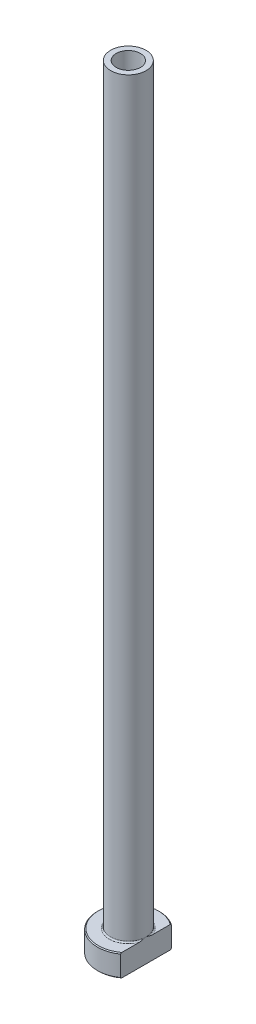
ISO-10303-21;
HEADER;
FILE_DESCRIPTION(('STEP AP214'),'2;1');
FILE_NAME('part.step','',(''),(''),'','','');
FILE_SCHEMA(('AUTOMOTIVE_DESIGN { 1 0 10303 214 1 1 1 1 }'));
ENDSEC;
DATA;
#1=APPLICATION_CONTEXT('core data for automotive mechanical design processes');
#2=APPLICATION_PROTOCOL_DEFINITION('international standard','automotive_design',2000,#1);
#3=PRODUCT_CONTEXT('',#1,'mechanical');
#4=PRODUCT('Part','Part','',(#3));
#5=PRODUCT_RELATED_PRODUCT_CATEGORY('part','',(#4));
#6=PRODUCT_DEFINITION_FORMATION('','',#4);
#7=PRODUCT_DEFINITION_CONTEXT('part definition',#1,'design');
#8=PRODUCT_DEFINITION('design','',#6,#7);
#9=PRODUCT_DEFINITION_SHAPE('','',#8);
#10=(LENGTH_UNIT() NAMED_UNIT(*) SI_UNIT(.MILLI.,.METRE.));
#11=(NAMED_UNIT(*) PLANE_ANGLE_UNIT() SI_UNIT($,.RADIAN.));
#12=(NAMED_UNIT(*) SI_UNIT($,.STERADIAN.) SOLID_ANGLE_UNIT());
#13=UNCERTAINTY_MEASURE_WITH_UNIT(LENGTH_MEASURE(1.E-05),#10,'distance_accuracy_value','');
#14=(GEOMETRIC_REPRESENTATION_CONTEXT(3) GLOBAL_UNCERTAINTY_ASSIGNED_CONTEXT((#13)) GLOBAL_UNIT_ASSIGNED_CONTEXT((#10,
#11,#12)) REPRESENTATION_CONTEXT('',''));
#15=CARTESIAN_POINT('',(0.,0.,0.));
#16=DIRECTION('',(0.,0.,1.));
#17=DIRECTION('',(1.,0.,0.));
#18=AXIS2_PLACEMENT_3D('',#15,#16,#17);
#19=CARTESIAN_POINT('',(0.,92.1876809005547,0.));
#20=DIRECTION('',(0.,1.,0.));
#21=DIRECTION('',(0.,0.,1.));
#22=AXIS2_PLACEMENT_3D('',#19,#20,#21);
#23=CYLINDRICAL_SURFACE('',#22,2.75);
#24=CARTESIAN_POINT('',(0.,175.,0.));
#25=DIRECTION('',(0.,1.,0.));
#26=DIRECTION('',(0.,0.,1.));
#27=AXIS2_PLACEMENT_3D('',#24,#25,#26);
#28=CIRCLE('',#27,2.75);
#29=CARTESIAN_POINT('',(0.,175.,2.75));
#30=VERTEX_POINT('',#29);
#31=EDGE_CURVE('E167',#30,#30,#28,.T.);
#32=ORIENTED_EDGE('',*,*,#31,.T.);
#33=EDGE_LOOP('',(#32));
#34=FACE_BOUND('',#33,.T.);
#35=CARTESIAN_POINT('',(0.,130.,0.));
#36=DIRECTION('',(0.,1.,0.));
#37=DIRECTION('',(0.,0.,1.));
#38=AXIS2_PLACEMENT_3D('',#35,#36,#37);
#39=CIRCLE('',#38,2.75);
#40=CARTESIAN_POINT('',(0.,130.,2.75));
#41=VERTEX_POINT('',#40);
#42=EDGE_CURVE('E170',#41,#41,#39,.T.);
#43=ORIENTED_EDGE('',*,*,#42,.F.);
#44=EDGE_LOOP('',(#43));
#45=FACE_BOUND('',#44,.T.);
#46=ADVANCED_FACE('F32',(#34,#45),#23,.F.);
#47=CARTESIAN_POINT('',(-2.75,175.,0.));
#48=DIRECTION('',(0.,1.,0.));
#49=DIRECTION('',(0.,0.,1.));
#50=AXIS2_PLACEMENT_3D('',#47,#48,#49);
#51=PLANE('',#50);
#52=CARTESIAN_POINT('',(0.,175.,0.));
#53=DIRECTION('',(0.,1.,0.));
#54=DIRECTION('',(0.,0.,1.));
#55=AXIS2_PLACEMENT_3D('',#52,#53,#54);
#56=CIRCLE('',#55,4.00000000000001);
#57=CARTESIAN_POINT('',(0.,175.,4.00000000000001));
#58=VERTEX_POINT('',#57);
#59=EDGE_CURVE('E174',#58,#58,#56,.T.);
#60=ORIENTED_EDGE('',*,*,#59,.T.);
#61=EDGE_LOOP('',(#60));
#62=FACE_BOUND('',#61,.T.);
#63=ORIENTED_EDGE('',*,*,#31,.F.);
#64=EDGE_LOOP('',(#63));
#65=FACE_BOUND('',#64,.T.);
#66=ADVANCED_FACE('F157',(#62,#65),#51,.T.);
#67=CARTESIAN_POINT('',(0.,92.1876809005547,0.));
#68=DIRECTION('',(0.,1.,0.));
#69=DIRECTION('',(0.,0.,1.));
#70=AXIS2_PLACEMENT_3D('',#67,#68,#69);
#71=CYLINDRICAL_SURFACE('',#70,4.);
#72=CARTESIAN_POINT('',(0.,5.3,0.));
#73=DIRECTION('',(0.,1.,0.));
#74=DIRECTION('',(0.,0.,1.));
#75=AXIS2_PLACEMENT_3D('',#72,#73,#74);
#76=CIRCLE('',#75,4.);
#77=CARTESIAN_POINT('',(4.,5.3,0.));
#78=VERTEX_POINT('',#77);
#79=EDGE_CURVE('E180',#78,#78,#76,.T.);
#80=ORIENTED_EDGE('',*,*,#79,.T.);
#81=EDGE_LOOP('',(#80));
#82=FACE_BOUND('',#81,.T.);
#83=ORIENTED_EDGE('',*,*,#59,.F.);
#84=EDGE_LOOP('',(#83));
#85=FACE_BOUND('',#84,.T.);
#86=ADVANCED_FACE('F162',(#82,#85),#71,.T.);
#87=CARTESIAN_POINT('',(-3.99999999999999,5.,0.));
#88=DIRECTION('',(0.,1.,0.));
#89=DIRECTION('',(0.,0.,1.));
#90=AXIS2_PLACEMENT_3D('',#87,#88,#89);
#91=PLANE('',#90);
#92=DIRECTION('',(0.,0.,1.));
#93=VECTOR('',#92,1.);
#94=CARTESIAN_POINT('',(4.,5.,0.));
#95=LINE('',#94,#93);
#96=CARTESIAN_POINT('',(4.,5.,-5.499090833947));
#97=VERTEX_POINT('',#96);
#98=CARTESIAN_POINT('',(4.,5.,-1.57797338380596));
#99=VERTEX_POINT('',#98);
#100=EDGE_CURVE('E54',#97,#99,#95,.T.);
#101=ORIENTED_EDGE('',*,*,#100,.F.);
#102=CARTESIAN_POINT('',(0.,5.,0.));
#103=DIRECTION('',(0.,1.,0.));
#104=DIRECTION('',(0.,0.,1.));
#105=AXIS2_PLACEMENT_3D('',#102,#103,#104);
#106=CIRCLE('',#105,6.79999999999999);
#107=CARTESIAN_POINT('',(3.99999999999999,5.,5.499090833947));
#108=VERTEX_POINT('',#107);
#109=EDGE_CURVE('E186',#97,#108,#106,.T.);
#110=ORIENTED_EDGE('',*,*,#109,.T.);
#111=CARTESIAN_POINT('',(4.,5.,1.57797338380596));
#112=VERTEX_POINT('',#111);
#113=EDGE_CURVE('E134',#112,#108,#95,.T.);
#114=ORIENTED_EDGE('',*,*,#113,.F.);
#115=CARTESIAN_POINT('',(0.,5.,0.));
#116=DIRECTION('',(0.,1.,0.));
#117=DIRECTION('',(0.,0.,1.));
#118=AXIS2_PLACEMENT_3D('',#115,#116,#117);
#119=CIRCLE('',#118,4.3);
#120=EDGE_CURVE('E183',#112,#99,#119,.F.);
#121=ORIENTED_EDGE('',*,*,#120,.T.);
#122=EDGE_LOOP('',(#101,#110,#114,#121));
#123=FACE_BOUND('',#122,.T.);
#124=ADVANCED_FACE('F197',(#123),#91,.T.);
#125=CARTESIAN_POINT('',(0.,92.1876809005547,0.));
#126=DIRECTION('',(0.,1.,0.));
#127=DIRECTION('',(0.,0.,1.));
#128=AXIS2_PLACEMENT_3D('',#125,#126,#127);
#129=CYLINDRICAL_SURFACE('',#128,6.99999999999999);
#130=DIRECTION('',(0.,-1.,0.));
#131=VECTOR('',#130,1.);
#132=CARTESIAN_POINT('',(3.99999999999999,175.,5.74456264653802));
#133=LINE('',#132,#131);
#134=CARTESIAN_POINT('',(3.99999999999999,4.79999999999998,5.74456264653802));
#135=VERTEX_POINT('',#134);
#136=CARTESIAN_POINT('',(3.99999999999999,0.20000000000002,5.74456264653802));
#137=VERTEX_POINT('',#136);
#138=EDGE_CURVE('E82',#135,#137,#133,.T.);
#139=ORIENTED_EDGE('',*,*,#138,.F.);
#140=CARTESIAN_POINT('',(0.,4.79999999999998,0.));
#141=DIRECTION('',(0.,1.,0.));
#142=DIRECTION('',(0.,0.,1.));
#143=AXIS2_PLACEMENT_3D('',#140,#141,#142);
#144=CIRCLE('',#143,6.99999999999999);
#145=CARTESIAN_POINT('',(4.,4.79999999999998,-5.74456264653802));
#146=VERTEX_POINT('',#145);
#147=EDGE_CURVE('E95',#135,#146,#144,.F.);
#148=ORIENTED_EDGE('',*,*,#147,.T.);
#149=DIRECTION('',(0.,-1.,0.));
#150=VECTOR('',#149,1.);
#151=CARTESIAN_POINT('',(4.,175.,-5.74456264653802));
#152=LINE('',#151,#150);
#153=CARTESIAN_POINT('',(4.,0.20000000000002,-5.74456264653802));
#154=VERTEX_POINT('',#153);
#155=EDGE_CURVE('E192',#146,#154,#152,.T.);
#156=ORIENTED_EDGE('',*,*,#155,.T.);
#157=CARTESIAN_POINT('',(0.,0.20000000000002,0.));
#158=DIRECTION('',(0.,-1.,0.));
#159=DIRECTION('',(0.,0.,-1.));
#160=AXIS2_PLACEMENT_3D('',#157,#158,#159);
#161=CIRCLE('',#160,6.99999999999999);
#162=EDGE_CURVE('E98',#154,#137,#161,.F.);
#163=ORIENTED_EDGE('',*,*,#162,.T.);
#164=EDGE_LOOP('',(#139,#148,#156,#163));
#165=FACE_BOUND('',#164,.T.);
#166=ADVANCED_FACE('F190',(#165),#129,.T.);
#167=CARTESIAN_POINT('',(-6.99999999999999,0.,0.));
#168=DIRECTION('',(0.,-1.,0.));
#169=DIRECTION('',(0.,0.,-1.));
#170=AXIS2_PLACEMENT_3D('',#167,#168,#169);
#171=PLANE('',#170);
#172=CARTESIAN_POINT('',(0.,0.,0.));
#173=DIRECTION('',(0.,-1.,0.));
#174=DIRECTION('',(0.,0.,-1.));
#175=AXIS2_PLACEMENT_3D('',#172,#173,#174);
#176=CIRCLE('',#175,3.49999999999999);
#177=CARTESIAN_POINT('',(0.,0.,-3.49999999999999));
#178=VERTEX_POINT('',#177);
#179=EDGE_CURVE('E40',#178,#178,#176,.F.);
#180=ORIENTED_EDGE('',*,*,#179,.T.);
#181=EDGE_LOOP('',(#180));
#182=FACE_BOUND('',#181,.T.);
#183=DIRECTION('',(0.,0.,-1.));
#184=VECTOR('',#183,1.);
#185=CARTESIAN_POINT('',(3.99999999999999,0.,5.74456264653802));
#186=LINE('',#185,#184);
#187=CARTESIAN_POINT('',(3.99999999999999,0.,5.49909083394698));
#188=VERTEX_POINT('',#187);
#189=CARTESIAN_POINT('',(4.,0.,-5.49909083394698));
#190=VERTEX_POINT('',#189);
#191=EDGE_CURVE('E47',#188,#190,#186,.T.);
#192=ORIENTED_EDGE('',*,*,#191,.F.);
#193=CARTESIAN_POINT('',(0.,0.,0.));
#194=DIRECTION('',(0.,-1.,0.));
#195=DIRECTION('',(0.,0.,-1.));
#196=AXIS2_PLACEMENT_3D('',#193,#194,#195);
#197=CIRCLE('',#196,6.79999999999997);
#198=EDGE_CURVE('E92',#188,#190,#197,.T.);
#199=ORIENTED_EDGE('',*,*,#198,.T.);
#200=EDGE_LOOP('',(#192,#199));
#201=FACE_BOUND('',#200,.T.);
#202=ADVANCED_FACE('F91',(#182,#201),#171,.T.);
#203=CARTESIAN_POINT('',(0.,92.1876809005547,0.));
#204=DIRECTION('',(0.,1.,0.));
#205=DIRECTION('',(0.,0.,1.));
#206=AXIS2_PLACEMENT_3D('',#203,#204,#205);
#207=CYLINDRICAL_SURFACE('',#206,3.);
#208=CARTESIAN_POINT('',(0.,0.5,0.));
#209=DIRECTION('',(0.,-1.,0.));
#210=DIRECTION('',(0.,0.,-1.));
#211=AXIS2_PLACEMENT_3D('',#208,#209,#210);
#212=CIRCLE('',#211,3.);
#213=CARTESIAN_POINT('',(0.,0.5,-3.));
#214=VERTEX_POINT('',#213);
#215=EDGE_CURVE('E11',#214,#214,#212,.T.);
#216=ORIENTED_EDGE('',*,*,#215,.T.);
#217=EDGE_LOOP('',(#216));
#218=FACE_BOUND('',#217,.T.);
#219=CARTESIAN_POINT('',(0.,118.,0.));
#220=DIRECTION('',(0.,1.,0.));
#221=DIRECTION('',(0.,0.,1.));
#222=AXIS2_PLACEMENT_3D('',#219,#220,#221);
#223=CIRCLE('',#222,3.);
#224=CARTESIAN_POINT('',(0.,118.,3.));
#225=VERTEX_POINT('',#224);
#226=EDGE_CURVE('E172',#225,#225,#223,.T.);
#227=ORIENTED_EDGE('',*,*,#226,.T.);
#228=EDGE_LOOP('',(#227));
#229=FACE_BOUND('',#228,.T.);
#230=ADVANCED_FACE('F215',(#218,#229),#207,.F.);
#231=CARTESIAN_POINT('',(0.,118.,0.));
#232=DIRECTION('',(0.,-1.,0.));
#233=DIRECTION('',(0.,0.,-1.));
#234=AXIS2_PLACEMENT_3D('',#231,#232,#233);
#235=CONICAL_SURFACE('',#234,3.,0.0208303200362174);
#236=ORIENTED_EDGE('',*,*,#42,.T.);
#237=EDGE_LOOP('',(#236));
#238=FACE_BOUND('',#237,.T.);
#239=ORIENTED_EDGE('',*,*,#226,.F.);
#240=EDGE_LOOP('',(#239));
#241=FACE_BOUND('',#240,.T.);
#242=ADVANCED_FACE('F111',(#238,#241),#235,.F.);
#243=CARTESIAN_POINT('',(0.,5.3,0.));
#244=DIRECTION('',(0.,1.,0.));
#245=DIRECTION('',(0.,0.,1.));
#246=AXIS2_PLACEMENT_3D('',#243,#244,#245);
#247=TOROIDAL_SURFACE('',#246,4.3,0.3);
#248=ORIENTED_EDGE('',*,*,#120,.F.);
#249=CARTESIAN_POINT('',(4.,5.3,0.));
#250=CARTESIAN_POINT('',(4.,5.30000062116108,-1.06261529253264E-10));
#251=CARTESIAN_POINT('',(4.,5.30000124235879,2.17726073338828E-07));
#252=CARTESIAN_POINT('',(4.,5.30000240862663,8.36141018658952E-07));
#253=CARTESIAN_POINT('',(4.,5.30000294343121,1.2501168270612E-06));
#254=CARTESIAN_POINT('',(4.,5.30000404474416,2.23959340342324E-06));
#255=CARTESIAN_POINT('',(4.,5.30000459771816,2.83084465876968E-06));
#256=CARTESIAN_POINT('',(4.,5.30000559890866,4.0651660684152E-06));
#257=CARTESIAN_POINT('',(4.,5.30000604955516,4.70640086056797E-06));
#258=CARTESIAN_POINT('',(4.,5.3000076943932,7.15677214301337E-06));
#259=CARTESIAN_POINT('',(4.,5.3000087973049,9.02995984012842E-06));
#260=CARTESIAN_POINT('',(4.,5.30001063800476,1.27664888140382E-05));
#261=CARTESIAN_POINT('',(4.,5.30001139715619,1.46197807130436E-05));
#262=CARTESIAN_POINT('',(4.,5.30001453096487,2.23679224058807E-05));
#263=CARTESIAN_POINT('',(4.,5.30001683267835,2.82968752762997E-05));
#264=CARTESIAN_POINT('',(4.,5.30002027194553,3.95668733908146E-05));
#265=CARTESIAN_POINT('',(4.,5.30002152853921,4.48715464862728E-05));
#266=CARTESIAN_POINT('',(4.,5.30003060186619,8.40118205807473E-05));
#267=CARTESIAN_POINT('',(4.,5.30003739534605,0.000118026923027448));
#268=CARTESIAN_POINT('',(4.,5.30006713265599,0.00025221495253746));
#269=CARTESIAN_POINT('',(4.,5.30009559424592,0.00035113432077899));
#270=CARTESIAN_POINT('',(3.99999999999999,5.30020622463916,0.000742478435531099));
#271=CARTESIAN_POINT('',(4.,5.30028475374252,0.00103561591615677));
#272=CARTESIAN_POINT('',(4.,5.30059889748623,0.00219920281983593));
#273=CARTESIAN_POINT('',(4.,5.3008390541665,0.00306873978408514));
#274=CARTESIAN_POINT('',(3.99999999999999,5.30183682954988,0.00669141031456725));
#275=CARTESIAN_POINT('',(4.,5.30258877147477,0.00944568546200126));
#276=CARTESIAN_POINT('',(4.,5.31066890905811,0.0390293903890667));
#277=CARTESIAN_POINT('',(4.,5.31802631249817,0.0658531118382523));
#278=CARTESIAN_POINT('',(3.99999999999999,5.3323967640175,0.118441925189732));
#279=CARTESIAN_POINT('',(4.,5.33941183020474,0.144206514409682));
#280=CARTESIAN_POINT('',(4.,5.35427366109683,0.199017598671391));
#281=CARTESIAN_POINT('',(4.,5.36211313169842,0.228066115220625));
#282=CARTESIAN_POINT('',(4.,5.3777634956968,0.28651184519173));
#283=CARTESIAN_POINT('',(4.,5.38557313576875,0.315909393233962));
#284=CARTESIAN_POINT('',(4.,5.40425662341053,0.386994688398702));
#285=CARTESIAN_POINT('',(4.,5.41505237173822,0.428703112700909));
#286=CARTESIAN_POINT('',(4.,5.43592310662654,0.511098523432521));
#287=CARTESIAN_POINT('',(4.,5.44600969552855,0.551782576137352));
#288=CARTESIAN_POINT('',(4.,5.47850986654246,0.686599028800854));
#289=CARTESIAN_POINT('',(4.,5.4997837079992,0.781011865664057));
#290=CARTESIAN_POINT('',(4.,5.53807543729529,0.971847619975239));
#291=CARTESIAN_POINT('',(4.,5.5550427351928,1.06828120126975));
#292=CARTESIAN_POINT('',(4.,5.5758240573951,1.21752725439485));
#293=CARTESIAN_POINT('',(4.,5.5820979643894,1.26999379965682));
#294=CARTESIAN_POINT('',(4.,5.59210686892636,1.37516324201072));
#295=CARTESIAN_POINT('',(4.,5.59584265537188,1.42786606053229));
#296=CARTESIAN_POINT('',(4.,5.60010438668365,1.53310673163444));
#297=CARTESIAN_POINT('',(4.,5.6006487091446,1.58564378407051));
#298=CARTESIAN_POINT('',(4.,5.59767158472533,1.69058605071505));
#299=CARTESIAN_POINT('',(4.,5.59415502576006,1.74299134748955));
#300=CARTESIAN_POINT('',(4.,5.58503062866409,1.81903290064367));
#301=CARTESIAN_POINT('',(4.,5.58157617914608,1.84292934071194));
#302=CARTESIAN_POINT('',(4.,5.57329952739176,1.89051061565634));
#303=CARTESIAN_POINT('',(4.,5.56847619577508,1.91419525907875));
#304=CARTESIAN_POINT('',(4.,5.5572664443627,1.96092888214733));
#305=CARTESIAN_POINT('',(4.,5.55089740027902,1.98398195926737));
#306=CARTESIAN_POINT('',(4.,5.53623434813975,2.02945550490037));
#307=CARTESIAN_POINT('',(4.,5.52794253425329,2.05187666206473));
#308=CARTESIAN_POINT('',(4.,5.50887098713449,2.09590631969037));
#309=CARTESIAN_POINT('',(4.,5.49806837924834,2.1175050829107));
#310=CARTESIAN_POINT('',(4.,5.4733340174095,2.15885583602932));
#311=CARTESIAN_POINT('',(4.,5.45941272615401,2.17861369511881));
#312=CARTESIAN_POINT('',(4.,5.43588221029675,2.20522942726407));
#313=CARTESIAN_POINT('',(4.,5.42781139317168,2.21344043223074));
#314=CARTESIAN_POINT('',(4.,5.4106511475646,2.22875149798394));
#315=CARTESIAN_POINT('',(4.,5.40156129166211,2.23585108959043));
#316=CARTESIAN_POINT('',(4.,5.38220524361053,2.24859694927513));
#317=CARTESIAN_POINT('',(4.,5.37192420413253,2.25422119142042));
#318=CARTESIAN_POINT('',(4.,5.35045072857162,2.26331064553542));
#319=CARTESIAN_POINT('',(4.,5.3392612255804,2.26678251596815));
#320=CARTESIAN_POINT('',(4.,5.31952044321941,2.27051268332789));
#321=CARTESIAN_POINT('',(4.,5.31108453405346,2.27139016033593));
#322=CARTESIAN_POINT('',(4.,5.29418624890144,2.27168963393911));
#323=CARTESIAN_POINT('',(4.,5.28572387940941,2.27111196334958));
#324=CARTESIAN_POINT('',(4.,5.26904138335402,2.26855580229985));
#325=CARTESIAN_POINT('',(4.,5.2608206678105,2.26658107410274));
#326=CARTESIAN_POINT('',(4.,5.2447821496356,2.26139496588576));
#327=CARTESIAN_POINT('',(4.,5.2369646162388,2.25818277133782));
#328=CARTESIAN_POINT('',(4.,5.21851235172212,2.24908332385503));
#329=CARTESIAN_POINT('',(4.,5.20815219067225,2.24264095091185));
#330=CARTESIAN_POINT('',(4.,5.1885797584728,2.22819957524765));
#331=CARTESIAN_POINT('',(4.,5.17937061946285,2.22019647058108));
#332=CARTESIAN_POINT('',(4.,5.1566538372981,2.19777756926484));
#333=CARTESIAN_POINT('',(4.,5.14403484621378,2.18246908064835));
#334=CARTESIAN_POINT('',(4.,5.12118369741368,2.15020843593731));
#335=CARTESIAN_POINT('',(4.,5.1109548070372,2.13325407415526));
#336=CARTESIAN_POINT('',(4.,5.09273574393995,2.09892324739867));
#337=CARTESIAN_POINT('',(4.,5.08468212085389,2.08157988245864));
#338=CARTESIAN_POINT('',(4.,5.07005901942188,2.04627072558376));
#339=CARTESIAN_POINT('',(4.,5.06349101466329,2.02830433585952));
#340=CARTESIAN_POINT('',(4.,5.04555485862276,1.97350761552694));
#341=CARTESIAN_POINT('',(4.,5.03608974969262,1.93605770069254));
#342=CARTESIAN_POINT('',(4.,5.01780569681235,1.84529235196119));
#343=CARTESIAN_POINT('',(4.,5.01077018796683,1.79164082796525));
#344=CARTESIAN_POINT('',(4.,5.00182846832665,1.68379947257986));
#345=CARTESIAN_POINT('',(4.,4.99993887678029,1.62960846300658));
#346=CARTESIAN_POINT('',(4.,5.0000612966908,1.52361204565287));
#347=CARTESIAN_POINT('',(4.,5.00190698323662,1.47180551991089));
#348=CARTESIAN_POINT('',(4.,5.00841243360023,1.36835357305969));
#349=CARTESIAN_POINT('',(4.,5.01307376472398,1.31670825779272));
#350=CARTESIAN_POINT('',(4.,5.02905484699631,1.17431887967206));
#351=CARTESIAN_POINT('',(4.,5.04274090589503,1.08384207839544));
#352=CARTESIAN_POINT('',(4.,5.06701714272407,0.947757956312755));
#353=CARTESIAN_POINT('',(4.,5.07585573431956,0.901814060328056));
#354=CARTESIAN_POINT('',(4.,5.09458665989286,0.810008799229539));
#355=CARTESIAN_POINT('',(4.,5.10448180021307,0.764148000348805));
#356=CARTESIAN_POINT('',(4.,5.12892434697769,0.655631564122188));
#357=CARTESIAN_POINT('',(3.99999999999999,5.14383556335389,0.593058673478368));
#358=CARTESIAN_POINT('',(4.,5.17458762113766,0.468885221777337));
#359=CARTESIAN_POINT('',(4.,5.19041623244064,0.407281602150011));
#360=CARTESIAN_POINT('',(3.99999999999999,5.22090834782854,0.291232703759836));
#361=CARTESIAN_POINT('',(3.99999999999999,5.23550024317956,0.2367683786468));
#362=CARTESIAN_POINT('',(4.00000000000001,5.26562550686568,0.125604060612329));
#363=CARTESIAN_POINT('',(4.00000000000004,5.28117250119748,0.0689076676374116));
#364=CARTESIAN_POINT('',(3.99999999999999,5.29741226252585,0.00944154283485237));
#365=CARTESIAN_POINT('',(3.99999999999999,5.29816540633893,0.00668315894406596));
#366=CARTESIAN_POINT('',(4.,5.29916346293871,0.00305954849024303));
#367=CARTESIAN_POINT('',(4.,5.29940273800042,0.00219318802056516));
#368=CARTESIAN_POINT('',(3.99999999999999,5.29971580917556,0.00103357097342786));
#369=CARTESIAN_POINT('',(3.99999999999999,5.29979412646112,0.000741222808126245));
#370=CARTESIAN_POINT('',(4.,5.29990450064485,0.00035080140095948));
#371=CARTESIAN_POINT('',(4.,5.29993292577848,0.000252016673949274));
#372=CARTESIAN_POINT('',(3.99999999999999,5.29996263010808,0.000117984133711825));
#373=CARTESIAN_POINT('',(3.99999999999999,5.29996941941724,8.39881898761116E-05));
#374=CARTESIAN_POINT('',(4.,5.29997848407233,4.48674015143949E-05));
#375=CARTESIAN_POINT('',(4.,5.29997973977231,3.95638189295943E-05));
#376=CARTESIAN_POINT('',(4.,5.29998317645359,2.8296033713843E-05));
#377=CARTESIAN_POINT('',(4.,5.29998547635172,2.23681454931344E-05));
#378=CARTESIAN_POINT('',(4.,5.29998860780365,1.46211000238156E-05));
#379=CARTESIAN_POINT('',(4.,5.29998936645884,1.2767889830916E-05));
#380=CARTESIAN_POINT('',(4.,5.29999120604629,9.03144036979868E-06));
#381=CARTESIAN_POINT('',(4.,5.29999230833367,7.15824074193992E-06));
#382=CARTESIAN_POINT('',(4.,5.29999395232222,4.70775514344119E-06));
#383=CARTESIAN_POINT('',(4.,5.29999440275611,4.06646377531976E-06));
#384=CARTESIAN_POINT('',(4.,5.29999540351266,2.83199084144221E-06));
#385=CARTESIAN_POINT('',(4.,5.29999595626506,2.24064341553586E-06));
#386=CARTESIAN_POINT('',(4.,5.2999970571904,1.25093972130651E-06));
#387=CARTESIAN_POINT('',(4.,5.29999759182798,8.36841075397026E-07));
#388=CARTESIAN_POINT('',(4.,5.29999875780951,2.18117755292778E-07));
#389=CARTESIAN_POINT('',(4.,5.29999937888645,1.06254606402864E-10));
#390=CARTESIAN_POINT('',(4.,5.3,0.));
#391=B_SPLINE_CURVE_WITH_KNOTS('',3,(#249,#250,#251,#252,#253,#254,#255,#256,#257,#258,#259,
#260,#261,#262,#263,#264,#265,#266,#267,#268,#269,#270,#271,#272,#273,#274,#275,#276,#277,#278,
#279,#280,#281,#282,#283,#284,#285,#286,#287,#288,#289,#290,#291,#292,#293,#294,#295,#296,#297,
#298,#299,#300,#301,#302,#303,#304,#305,#306,#307,#308,#309,#310,#311,#312,#313,#314,#315,#316,
#317,#318,#319,#320,#321,#322,#323,#324,#325,#326,#327,#328,#329,#330,#331,#332,#333,#334,#335,
#336,#337,#338,#339,#340,#341,#342,#343,#344,#345,#346,#347,#348,#349,#350,#351,#352,#353,#354,
#355,#356,#357,#358,#359,#360,#361,#362,#363,#364,#365,#366,#367,#368,#369,#370,#371,#372,#373,
#374,#375,#376,#377,#378,#379,#380,#381,#382,#383,#384,#385,#386,#387,#388,#389,#390),
.UNSPECIFIED.,.T.,.F.,(4,2,2,2,2,2,2,2,2,2,2,2,2,2,2,2,2,2,2,2,2,2,2,2,2,2,2,2,2,2,2,2,2,2,2,2,
2,2,2,2,2,2,2,2,2,2,2,2,2,2,2,2,2,2,2,2,2,2,2,2,2,2,2,2,2,2,2,2,2,2,4),(0.,1.87484430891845E-06,
3.90180055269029E-06,6.31683886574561E-06,8.66652039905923E-06,1.51627563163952E-05,
2.1165794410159E-05,4.020907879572E-05,5.65429486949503E-05,0.000160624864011,
0.000469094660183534,0.00137985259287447,0.00408571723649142,0.0126514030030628,
0.0960918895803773,0.176200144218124,0.266463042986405,0.357714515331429,0.486961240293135,
0.61270708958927,0.902988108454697,1.196535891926,1.35501075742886,1.51343634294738,
1.67094875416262,1.82827177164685,1.90067591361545,1.97313996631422,2.04482437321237,
2.11642737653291,2.18871023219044,2.26075412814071,2.29521947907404,2.32969934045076,
2.36466792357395,2.39952778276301,2.42485422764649,2.45017488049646,2.47542760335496,
2.50069697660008,2.53708899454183,2.57357798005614,2.63276032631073,2.69202310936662,
2.74930315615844,2.80663977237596,2.92223125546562,3.08420752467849,3.24670629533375,
3.40212850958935,3.55763731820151,3.83192962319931,3.97228382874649,4.11302057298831,
4.30598130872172,4.49678885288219,4.66594443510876,4.84230602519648,4.85088453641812,
4.85358051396,4.8544888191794,4.85479687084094,4.8549008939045,4.8549172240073,4.85493626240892,
4.85494226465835,4.85494875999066,4.85495110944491,4.85495352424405,4.85495555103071,
4.85495742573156),.UNSPECIFIED.);
#392=EDGE_CURVE('E126',#112,#78,#391,.T.);
#393=ORIENTED_EDGE('',*,*,#392,.T.);
#394=ORIENTED_EDGE('',*,*,#79,.F.);
#395=CARTESIAN_POINT('',(4.,5.3,0.));
#396=CARTESIAN_POINT('',(4.,5.29999937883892,1.06262853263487E-10));
#397=CARTESIAN_POINT('',(4.,5.29999875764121,-2.17726072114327E-07));
#398=CARTESIAN_POINT('',(4.,5.29999759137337,-8.36141017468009E-07));
#399=CARTESIAN_POINT('',(4.,5.29999705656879,-1.25011682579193E-06));
#400=CARTESIAN_POINT('',(4.,5.29999595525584,-2.23959340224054E-06));
#401=CARTESIAN_POINT('',(4.,5.29999540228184,-2.83084465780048E-06));
#402=CARTESIAN_POINT('',(4.,5.29999440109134,-4.06516606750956E-06));
#403=CARTESIAN_POINT('',(4.,5.29999395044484,-4.70640085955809E-06));
#404=CARTESIAN_POINT('',(4.,5.2999923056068,-7.15677214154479E-06));
#405=CARTESIAN_POINT('',(4.,5.2999912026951,-9.02995983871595E-06));
#406=CARTESIAN_POINT('',(4.,5.29998936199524,-1.27664888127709E-05));
#407=CARTESIAN_POINT('',(4.,5.29998860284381,-1.46197807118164E-05));
#408=CARTESIAN_POINT('',(4.,5.29998546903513,-2.2367922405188E-05));
#409=CARTESIAN_POINT('',(4.,5.29998316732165,-2.82968752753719E-05));
#410=CARTESIAN_POINT('',(4.,5.29997972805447,-3.95668733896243E-05));
#411=CARTESIAN_POINT('',(4.,5.29997847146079,-4.48715464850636E-05));
#412=CARTESIAN_POINT('',(4.,5.29996939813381,-8.40118205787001E-05));
#413=CARTESIAN_POINT('',(4.,5.29996260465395,-0.000118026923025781));
#414=CARTESIAN_POINT('',(4.,5.29993286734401,-0.000252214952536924));
#415=CARTESIAN_POINT('',(4.,5.29990440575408,-0.000351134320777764));
#416=CARTESIAN_POINT('',(3.99999999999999,5.29979377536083,-0.000742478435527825));
#417=CARTESIAN_POINT('',(4.,5.29971524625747,-0.00103561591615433));
#418=CARTESIAN_POINT('',(4.,5.29940110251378,-0.00219920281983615));
#419=CARTESIAN_POINT('',(4.,5.2991609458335,-0.00306873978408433));
#420=CARTESIAN_POINT('',(3.99999999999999,5.29816317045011,-0.00669141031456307));
#421=CARTESIAN_POINT('',(4.,5.29741122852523,-0.00944568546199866));
#422=CARTESIAN_POINT('',(4.,5.28933109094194,-0.0390293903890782));
#423=CARTESIAN_POINT('',(4.,5.28197368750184,-0.0658531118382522));
#424=CARTESIAN_POINT('',(3.99999999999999,5.26760323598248,-0.118441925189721));
#425=CARTESIAN_POINT('',(4.,5.26058816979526,-0.144206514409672));
#426=CARTESIAN_POINT('',(4.,5.24572633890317,-0.199017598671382));
#427=CARTESIAN_POINT('',(4.,5.23788686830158,-0.228066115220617));
#428=CARTESIAN_POINT('',(4.,5.2222365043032,-0.286511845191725));
#429=CARTESIAN_POINT('',(4.,5.21442686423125,-0.315909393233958));
#430=CARTESIAN_POINT('',(4.,5.19574337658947,-0.386994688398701));
#431=CARTESIAN_POINT('',(4.,5.18494762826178,-0.428703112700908));
#432=CARTESIAN_POINT('',(4.,5.16407689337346,-0.511098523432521));
#433=CARTESIAN_POINT('',(4.,5.15399030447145,-0.551782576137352));
#434=CARTESIAN_POINT('',(4.,5.12149013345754,-0.686599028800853));
#435=CARTESIAN_POINT('',(4.,5.1002162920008,-0.781011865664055));
#436=CARTESIAN_POINT('',(4.,5.06192456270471,-0.971847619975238));
#437=CARTESIAN_POINT('',(4.,5.0449572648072,-1.06828120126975));
#438=CARTESIAN_POINT('',(4.,5.02417594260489,-1.21752725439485));
#439=CARTESIAN_POINT('',(4.,5.01790203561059,-1.26999379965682));
#440=CARTESIAN_POINT('',(4.,5.00789313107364,-1.37516324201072));
#441=CARTESIAN_POINT('',(4.,5.00415734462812,-1.42786606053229));
#442=CARTESIAN_POINT('',(4.,4.99989561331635,-1.53310673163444));
#443=CARTESIAN_POINT('',(4.,4.9993512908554,-1.58564378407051));
#444=CARTESIAN_POINT('',(4.,5.00232841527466,-1.69058605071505));
#445=CARTESIAN_POINT('',(4.,5.00584497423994,-1.74299134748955));
#446=CARTESIAN_POINT('',(4.,5.0149693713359,-1.81903290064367));
#447=CARTESIAN_POINT('',(4.,5.01842382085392,-1.84292934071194));
#448=CARTESIAN_POINT('',(4.,5.02670047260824,-1.89051061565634));
#449=CARTESIAN_POINT('',(4.,5.03152380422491,-1.91419525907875));
#450=CARTESIAN_POINT('',(4.,5.0427335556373,-1.96092888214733));
#451=CARTESIAN_POINT('',(4.,5.04910259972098,-1.98398195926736));
#452=CARTESIAN_POINT('',(4.,5.06376565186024,-2.02945550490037));
#453=CARTESIAN_POINT('',(4.,5.07205746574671,-2.05187666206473));
#454=CARTESIAN_POINT('',(4.,5.09112901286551,-2.09590631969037));
#455=CARTESIAN_POINT('',(4.,5.10193162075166,-2.1175050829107));
#456=CARTESIAN_POINT('',(4.,5.1266659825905,-2.15885583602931));
#457=CARTESIAN_POINT('',(4.,5.14058727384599,-2.17861369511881));
#458=CARTESIAN_POINT('',(4.,5.16411778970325,-2.20522942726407));
#459=CARTESIAN_POINT('',(4.,5.17218860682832,-2.21344043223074));
#460=CARTESIAN_POINT('',(4.,5.1893488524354,-2.22875149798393));
#461=CARTESIAN_POINT('',(4.,5.19843870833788,-2.23585108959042));
#462=CARTESIAN_POINT('',(4.,5.21779475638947,-2.24859694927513));
#463=CARTESIAN_POINT('',(4.,5.22807579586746,-2.25422119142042));
#464=CARTESIAN_POINT('',(4.,5.24954927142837,-2.26331064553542));
#465=CARTESIAN_POINT('',(4.,5.2607387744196,-2.26678251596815));
#466=CARTESIAN_POINT('',(4.,5.28047955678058,-2.27051268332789));
#467=CARTESIAN_POINT('',(4.,5.28891546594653,-2.27139016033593));
#468=CARTESIAN_POINT('',(4.,5.30581375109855,-2.27168963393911));
#469=CARTESIAN_POINT('',(4.,5.31427612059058,-2.27111196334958));
#470=CARTESIAN_POINT('',(4.,5.33095861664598,-2.26855580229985));
#471=CARTESIAN_POINT('',(4.,5.3391793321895,-2.26658107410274));
#472=CARTESIAN_POINT('',(4.,5.35521785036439,-2.26139496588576));
#473=CARTESIAN_POINT('',(4.,5.3630353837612,-2.25818277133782));
#474=CARTESIAN_POINT('',(4.,5.38148764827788,-2.24908332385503));
#475=CARTESIAN_POINT('',(4.,5.39184780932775,-2.24264095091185));
#476=CARTESIAN_POINT('',(4.,5.4114202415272,-2.22819957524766));
#477=CARTESIAN_POINT('',(4.,5.42062938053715,-2.22019647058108));
#478=CARTESIAN_POINT('',(4.,5.44334616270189,-2.19777756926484));
#479=CARTESIAN_POINT('',(4.,5.45596515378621,-2.18246908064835));
#480=CARTESIAN_POINT('',(4.,5.47881630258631,-2.15020843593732));
#481=CARTESIAN_POINT('',(4.,5.48904519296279,-2.13325407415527));
#482=CARTESIAN_POINT('',(4.,5.50726425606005,-2.09892324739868));
#483=CARTESIAN_POINT('',(4.,5.51531787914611,-2.08157988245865));
#484=CARTESIAN_POINT('',(4.,5.52994098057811,-2.04627072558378));
#485=CARTESIAN_POINT('',(4.,5.5365089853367,-2.02830433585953));
#486=CARTESIAN_POINT('',(4.,5.55444514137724,-1.97350761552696));
#487=CARTESIAN_POINT('',(4.,5.56391025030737,-1.93605770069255));
#488=CARTESIAN_POINT('',(4.,5.58219430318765,-1.84529235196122));
#489=CARTESIAN_POINT('',(4.,5.58922981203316,-1.79164082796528));
#490=CARTESIAN_POINT('',(4.,5.59817153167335,-1.68379947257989));
#491=CARTESIAN_POINT('',(4.,5.60006112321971,-1.62960846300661));
#492=CARTESIAN_POINT('',(4.,5.5999387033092,-1.52361204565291));
#493=CARTESIAN_POINT('',(4.,5.59809301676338,-1.47180551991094));
#494=CARTESIAN_POINT('',(4.,5.59158756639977,-1.36835357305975));
#495=CARTESIAN_POINT('',(4.,5.58692623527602,-1.31670825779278));
#496=CARTESIAN_POINT('',(4.,5.57094515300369,-1.17431887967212));
#497=CARTESIAN_POINT('',(4.,5.55725909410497,-1.08384207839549));
#498=CARTESIAN_POINT('',(4.,5.53298285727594,-0.947757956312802));
#499=CARTESIAN_POINT('',(4.,5.52414426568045,-0.901814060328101));
#500=CARTESIAN_POINT('',(4.,5.50541334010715,-0.810008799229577));
#501=CARTESIAN_POINT('',(4.,5.49551819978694,-0.764148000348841));
#502=CARTESIAN_POINT('',(4.,5.47107565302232,-0.655631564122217));
#503=CARTESIAN_POINT('',(4.,5.45616443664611,-0.593058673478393));
#504=CARTESIAN_POINT('',(4.,5.42541237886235,-0.468885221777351));
#505=CARTESIAN_POINT('',(4.,5.40958376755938,-0.407281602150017));
#506=CARTESIAN_POINT('',(3.99999999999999,5.37909165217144,-0.291232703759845));
#507=CARTESIAN_POINT('',(3.99999999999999,5.36449975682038,-0.236768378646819));
#508=CARTESIAN_POINT('',(4.,5.33437449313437,-0.125604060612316));
#509=CARTESIAN_POINT('',(4.,5.31882749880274,-0.0689076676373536));
#510=CARTESIAN_POINT('',(4.,5.30258773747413,-0.00944154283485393));
#511=CARTESIAN_POINT('',(3.99999999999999,5.30183459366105,-0.00668315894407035));
#512=CARTESIAN_POINT('',(4.,5.30083653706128,-0.00305954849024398));
#513=CARTESIAN_POINT('',(4.,5.30059726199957,-0.00219318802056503));
#514=CARTESIAN_POINT('',(4.,5.30028419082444,-0.0010335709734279));
#515=CARTESIAN_POINT('',(3.99999999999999,5.30020587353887,-0.000741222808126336));
#516=CARTESIAN_POINT('',(4.,5.30009549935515,-0.000350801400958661));
#517=CARTESIAN_POINT('',(4.,5.30006707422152,-0.000252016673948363));
#518=CARTESIAN_POINT('',(4.,5.30003736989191,-0.000117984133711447));
#519=CARTESIAN_POINT('',(4.,5.30003058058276,-8.39881898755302E-05));
#520=CARTESIAN_POINT('',(4.,5.30002151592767,-4.48674015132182E-05));
#521=CARTESIAN_POINT('',(4.,5.30002026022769,-3.95638189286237E-05));
#522=CARTESIAN_POINT('',(4.,5.30001682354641,-2.82960337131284E-05));
#523=CARTESIAN_POINT('',(4.,5.30001452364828,-2.23681454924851E-05));
#524=CARTESIAN_POINT('',(4.,5.30001139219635,-1.46211000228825E-05));
#525=CARTESIAN_POINT('',(4.,5.30001063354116,-1.27678898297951E-05));
#526=CARTESIAN_POINT('',(4.,5.30000879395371,-9.03144036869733E-06));
#527=CARTESIAN_POINT('',(4.,5.30000769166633,-7.15824074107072E-06));
#528=CARTESIAN_POINT('',(4.,5.30000604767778,-4.70775514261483E-06));
#529=CARTESIAN_POINT('',(4.,5.30000559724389,-4.06646377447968E-06));
#530=CARTESIAN_POINT('',(4.,5.30000459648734,-2.83199084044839E-06));
#531=CARTESIAN_POINT('',(4.,5.30000404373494,-2.24064341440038E-06));
#532=CARTESIAN_POINT('',(4.,5.3000029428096,-1.25093971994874E-06));
#533=CARTESIAN_POINT('',(4.,5.30000240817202,-8.36841073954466E-07));
#534=CARTESIAN_POINT('',(4.,5.30000124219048,-2.18117754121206E-07));
#535=CARTESIAN_POINT('',(4.,5.30000062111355,-1.06253514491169E-10));
#536=CARTESIAN_POINT('',(4.,5.3,0.));
#537=B_SPLINE_CURVE_WITH_KNOTS('',3,(#395,#396,#397,#398,#399,#400,#401,#402,#403,#404,#405,
#406,#407,#408,#409,#410,#411,#412,#413,#414,#415,#416,#417,#418,#419,#420,#421,#422,#423,#424,
#425,#426,#427,#428,#429,#430,#431,#432,#433,#434,#435,#436,#437,#438,#439,#440,#441,#442,#443,
#444,#445,#446,#447,#448,#449,#450,#451,#452,#453,#454,#455,#456,#457,#458,#459,#460,#461,#462,
#463,#464,#465,#466,#467,#468,#469,#470,#471,#472,#473,#474,#475,#476,#477,#478,#479,#480,#481,
#482,#483,#484,#485,#486,#487,#488,#489,#490,#491,#492,#493,#494,#495,#496,#497,#498,#499,#500,
#501,#502,#503,#504,#505,#506,#507,#508,#509,#510,#511,#512,#513,#514,#515,#516,#517,#518,#519,
#520,#521,#522,#523,#524,#525,#526,#527,#528,#529,#530,#531,#532,#533,#534,#535,#536),
.UNSPECIFIED.,.T.,.F.,(4,2,2,2,2,2,2,2,2,2,2,2,2,2,2,2,2,2,2,2,2,2,2,2,2,2,2,2,2,2,2,2,2,2,2,2,
2,2,2,2,2,2,2,2,2,2,2,2,2,2,2,2,2,2,2,2,2,2,2,2,2,2,2,2,2,2,2,2,2,2,4),(0.,1.87484430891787E-06,
3.90180055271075E-06,6.31683886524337E-06,8.66652039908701E-06,1.51627563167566E-05,
2.11657944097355E-05,4.0209078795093E-05,5.6542948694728E-05,0.000160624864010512,
0.000469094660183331,0.00137985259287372,0.00408571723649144,0.0126514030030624,
0.0960918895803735,0.176200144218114,0.2664630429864,0.357714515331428,0.486961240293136,
0.61270708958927,0.902988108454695,1.196535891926,1.35501075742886,1.51343634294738,
1.67094875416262,1.82827177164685,1.90067591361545,1.97313996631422,2.04482437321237,
2.1164273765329,2.18871023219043,2.26075412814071,2.29521947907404,2.32969934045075,
2.36466792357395,2.39952778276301,2.42485422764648,2.45017488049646,2.47542760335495,
2.50069697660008,2.53708899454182,2.57357798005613,2.63276032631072,2.69202310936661,
2.74930315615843,2.80663977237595,2.9222312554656,3.08420752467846,3.24670629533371,
3.40212850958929,3.55763731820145,3.83192962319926,3.97228382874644,4.11302057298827,
4.3059813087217,4.49678885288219,4.66594443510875,4.84230602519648,4.85088453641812,
4.85358051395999,4.85448881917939,4.85479687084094,4.8549008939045,4.8549172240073,
4.85493626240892,4.85494226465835,4.85494875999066,4.85495110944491,4.85495352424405,
4.85495555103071,4.85495742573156),.UNSPECIFIED.);
#538=EDGE_CURVE('E135',#78,#99,#537,.T.);
#539=ORIENTED_EDGE('',*,*,#538,.T.);
#540=EDGE_LOOP('',(#248,#393,#394,#539));
#541=FACE_BOUND('',#540,.T.);
#542=ADVANCED_FACE('F141',(#541),#247,.F.);
#543=CARTESIAN_POINT('',(0.,5.,0.));
#544=DIRECTION('',(0.,-1.,0.));
#545=DIRECTION('',(0.,0.,-1.));
#546=AXIS2_PLACEMENT_3D('',#543,#544,#545);
#547=CONICAL_SURFACE('',#546,6.79999999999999,0.785398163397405);
#548=CARTESIAN_POINT('',(4.,-1.45712845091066,-12.6392822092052));
#549=CARTESIAN_POINT('',(4.,-1.24364466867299,-12.4153556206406));
#550=CARTESIAN_POINT('',(4.,-1.03042430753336,-12.1911774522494));
#551=CARTESIAN_POINT('',(4.,-0.604617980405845,-11.7422167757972));
#552=CARTESIAN_POINT('',(4.,-0.392032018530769,-11.5174342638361));
#553=CARTESIAN_POINT('',(4.,0.0324624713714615,-11.0670952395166));
#554=CARTESIAN_POINT('',(4.,0.244370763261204,-10.8415385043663));
#555=CARTESIAN_POINT('',(4.,0.667290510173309,-10.3895875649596));
#556=CARTESIAN_POINT('',(4.,0.878301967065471,-10.1631933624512));
#557=CARTESIAN_POINT('',(4.,1.51385375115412,-9.47810122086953));
#558=CARTESIAN_POINT('',(4.,1.93676291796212,-9.017882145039));
#559=CARTESIAN_POINT('',(4.,2.56612335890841,-8.32309905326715));
#560=CARTESIAN_POINT('',(4.,2.77505666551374,-8.09078457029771));
#561=CARTESIAN_POINT('',(4.,3.19080254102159,-7.62426940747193));
#562=CARTESIAN_POINT('',(4.,3.39761512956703,-7.39006874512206));
#563=CARTESIAN_POINT('',(4.,3.87870763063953,-6.83891844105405));
#564=CARTESIAN_POINT('',(4.,4.15190978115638,-6.52102188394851));
#565=CARTESIAN_POINT('',(4.,4.55642425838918,-6.03960901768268));
#566=CARTESIAN_POINT('',(4.,4.69041050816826,-5.87833992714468));
#567=CARTESIAN_POINT('',(4.,4.95616531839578,-5.55398469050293));
#568=CARTESIAN_POINT('',(4.,5.08793391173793,-5.39089857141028));
#569=CARTESIAN_POINT('',(4.,5.34841712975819,-5.06288801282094));
#570=CARTESIAN_POINT('',(4.,5.47713786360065,-4.89796843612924));
#571=CARTESIAN_POINT('',(4.,5.73107494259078,-4.56545535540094));
#572=CARTESIAN_POINT('',(4.,5.85629144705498,-4.39786197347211));
#573=CARTESIAN_POINT('',(4.,6.10211465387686,-4.05948444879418));
#574=CARTESIAN_POINT('',(4.,6.22272435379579,-3.88870249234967));
#575=CARTESIAN_POINT('',(4.,6.45796076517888,-3.5430831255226));
#576=CARTESIAN_POINT('',(4.,6.57258867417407,-3.3682465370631));
#577=CARTESIAN_POINT('',(4.,6.76866603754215,-3.05381396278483));
#578=CARTESIAN_POINT('',(4.,6.85173773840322,-2.9152335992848));
#579=CARTESIAN_POINT('',(4.,7.01174537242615,-2.63451965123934));
#580=CARTESIAN_POINT('',(4.,7.08868042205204,-2.49238555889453));
#581=CARTESIAN_POINT('',(4.,7.23459437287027,-2.20416961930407));
#582=CARTESIAN_POINT('',(4.,7.3035783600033,-2.05809037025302));
#583=CARTESIAN_POINT('',(4.,7.43135520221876,-1.7615173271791));
#584=CARTESIAN_POINT('',(4.,7.49015114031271,-1.61102488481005));
#585=CARTESIAN_POINT('',(4.,7.58249315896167,-1.3414209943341));
#586=CARTESIAN_POINT('',(4.,7.6187266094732,-1.22323501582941));
#587=CARTESIAN_POINT('',(4.,7.68223354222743,-0.984492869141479));
#588=CARTESIAN_POINT('',(4.,7.70951040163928,-0.863937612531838));
#589=CARTESIAN_POINT('',(4.,7.75377914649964,-0.621342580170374));
#590=CARTESIAN_POINT('',(4.,7.77080509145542,-0.499309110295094));
#591=CARTESIAN_POINT('',(4.,7.79378778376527,-0.25419448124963));
#592=CARTESIAN_POINT('',(4.,7.79974523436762,-0.13111338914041));
#593=CARTESIAN_POINT('',(4.,7.8002395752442,0.115517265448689));
#594=CARTESIAN_POINT('',(4.,7.79473514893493,0.239066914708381));
#595=CARTESIAN_POINT('',(4.,7.77255119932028,0.485148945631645));
#596=CARTESIAN_POINT('',(4.,7.75587091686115,0.60768125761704));
#597=CARTESIAN_POINT('',(4.,7.71218353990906,0.851269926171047));
#598=CARTESIAN_POINT('',(4.,7.68514362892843,0.972320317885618));
#599=CARTESIAN_POINT('',(4.,7.62201202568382,1.21200276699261));
#600=CARTESIAN_POINT('',(4.,7.5859196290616,1.3306346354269));
#601=CARTESIAN_POINT('',(4.,7.45980070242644,1.70122439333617));
#602=CARTESIAN_POINT('',(4.,7.35572950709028,1.94843335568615));
#603=CARTESIAN_POINT('',(4.,7.18186715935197,2.31048534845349));
#604=CARTESIAN_POINT('',(4.,7.12087684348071,2.42983561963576));
#605=CARTESIAN_POINT('',(4.,6.99403531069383,2.66593629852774));
#606=CARTESIAN_POINT('',(3.99999999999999,6.92818466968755,2.78268701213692));
#607=CARTESIAN_POINT('',(3.99999999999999,6.79157875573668,3.01550895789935));
#608=CARTESIAN_POINT('',(3.99999999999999,6.72076681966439,3.1315466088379));
#609=CARTESIAN_POINT('',(3.99999999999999,6.5758311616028,3.36153379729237));
#610=CARTESIAN_POINT('',(3.99999999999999,6.50170736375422,3.47548328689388));
#611=CARTESIAN_POINT('',(3.99999999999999,6.35080982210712,3.70145107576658));
#612=CARTESIAN_POINT('',(3.99999999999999,6.27403866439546,3.8134711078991));
#613=CARTESIAN_POINT('',(3.99999999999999,6.11824120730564,4.03592316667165));
#614=CARTESIAN_POINT('',(3.99999999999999,6.03921496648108,4.14635523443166));
#615=CARTESIAN_POINT('',(3.99999999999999,5.81506547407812,4.45397159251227));
#616=CARTESIAN_POINT('',(3.99999999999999,5.66782256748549,4.6496112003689));
#617=CARTESIAN_POINT('',(3.99999999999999,5.36880597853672,5.03740600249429));
#618=CARTESIAN_POINT('',(3.99999999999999,5.21703183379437,5.22956083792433));
#619=CARTESIAN_POINT('',(3.99999999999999,4.90999105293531,5.61115465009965));
#620=CARTESIAN_POINT('',(3.99999999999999,4.75472331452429,5.80059273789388));
#621=CARTESIAN_POINT('',(3.99999999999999,4.44150758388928,6.17724364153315));
#622=CARTESIAN_POINT('',(3.99999999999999,4.28355951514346,6.36445639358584));
#623=CARTESIAN_POINT('',(3.99999999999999,3.96525805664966,6.73740614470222));
#624=CARTESIAN_POINT('',(3.99999999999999,3.80490084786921,6.92313987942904));
#625=CARTESIAN_POINT('',(3.99999999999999,3.48247055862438,7.29311320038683));
#626=CARTESIAN_POINT('',(3.99999999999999,3.32039746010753,7.47735277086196));
#627=CARTESIAN_POINT('',(3.99999999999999,2.83216188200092,8.02814826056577));
#628=CARTESIAN_POINT('',(3.99999999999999,2.5039169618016,8.39285790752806));
#629=CARTESIAN_POINT('',(3.99999999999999,1.87512078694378,9.08414492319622));
#630=CARTESIAN_POINT('',(3.99999999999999,1.57491666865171,9.41103929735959));
#631=CARTESIAN_POINT('',(3.99999999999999,0.972153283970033,10.0626830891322));
#632=CARTESIAN_POINT('',(3.99999999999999,0.669593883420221,10.387432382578));
#633=CARTESIAN_POINT('',(3.99999999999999,0.0637759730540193,11.0341169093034));
#634=CARTESIAN_POINT('',(3.99999999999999,-0.239476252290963,11.356058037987));
#635=CARTESIAN_POINT('',(3.99999999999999,-0.847356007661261,11.9985921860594));
#636=CARTESIAN_POINT('',(3.99999999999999,-1.15198342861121,12.3191853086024));
#637=CARTESIAN_POINT('',(3.99999999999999,-1.45712845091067,12.6392822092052));
#638=B_SPLINE_CURVE_WITH_KNOTS('',3,(#548,#549,#550,#551,#552,#553,#554,#555,#556,#557,#558,
#559,#560,#561,#562,#563,#564,#565,#566,#567,#568,#569,#570,#571,#572,#573,#574,#575,#576,#577,
#578,#579,#580,#581,#582,#583,#584,#585,#586,#587,#588,#589,#590,#591,#592,#593,#594,#595,#596,
#597,#598,#599,#600,#601,#602,#603,#604,#605,#606,#607,#608,#609,#610,#611,#612,#613,#614,#615,
#616,#617,#618,#619,#620,#621,#622,#623,#624,#625,#626,#627,#628,#629,#630,#631,#632,#633,#634,
#635,#636,#637),.UNSPECIFIED.,.F.,.F.,(4,2,2,2,2,2,2,2,2,2,2,2,2,2,2,2,2,2,2,2,2,2,2,2,2,2,2,2,
2,2,2,2,2,2,2,2,2,2,2,2,2,2,2,2,4),(0.,0.928152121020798,1.85631024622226,2.78476262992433,
3.71321307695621,5.58823033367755,6.52556078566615,7.46288254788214,8.7202857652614,
9.34927045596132,9.97824580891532,10.6058302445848,11.2333861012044,11.860526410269,
12.4875406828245,12.9721363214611,13.4568016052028,13.9411551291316,14.4253618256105,
14.7959147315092,15.1663277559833,15.5355031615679,15.9046551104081,16.2751400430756,
16.645650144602,17.0173437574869,17.3890663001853,18.1913996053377,18.5934522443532,
18.9954573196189,19.403210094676,19.8109722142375,20.2183467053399,20.625710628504,
21.3601838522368,22.0947322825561,22.8295158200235,23.5643203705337,24.3004480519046,
25.0365834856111,26.5085499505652,27.8400191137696,29.1715646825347,30.4983881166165,
31.8251080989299),.UNSPECIFIED.);
#639=EDGE_CURVE('E133',#146,#97,#638,.T.);
#640=ORIENTED_EDGE('',*,*,#639,.F.);
#641=ORIENTED_EDGE('',*,*,#147,.F.);
#642=EDGE_CURVE('E118',#108,#135,#638,.T.);
#643=ORIENTED_EDGE('',*,*,#642,.F.);
#644=ORIENTED_EDGE('',*,*,#109,.F.);
#645=EDGE_LOOP('',(#640,#641,#643,#644));
#646=FACE_BOUND('',#645,.T.);
#647=ADVANCED_FACE('F145',(#646),#547,.T.);
#648=CARTESIAN_POINT('',(0.,0.20000000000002,0.));
#649=DIRECTION('',(0.,1.,0.));
#650=DIRECTION('',(0.,0.,1.));
#651=AXIS2_PLACEMENT_3D('',#648,#649,#650);
#652=CONICAL_SURFACE('',#651,6.99999999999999,0.78539816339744);
#653=CARTESIAN_POINT('',(3.99999999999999,6.45712845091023,12.6392822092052));
#654=CARTESIAN_POINT('',(3.99999999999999,6.24364466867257,12.4153556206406));
#655=CARTESIAN_POINT('',(3.99999999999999,6.03042430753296,12.1911774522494));
#656=CARTESIAN_POINT('',(3.99999999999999,5.60461798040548,11.7422167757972));
#657=CARTESIAN_POINT('',(3.99999999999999,5.39203201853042,11.5174342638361));
#658=CARTESIAN_POINT('',(3.99999999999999,4.96753752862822,11.0670952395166));
#659=CARTESIAN_POINT('',(3.99999999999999,4.75562923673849,10.8415385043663));
#660=CARTESIAN_POINT('',(3.99999999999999,4.33270948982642,10.3895875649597));
#661=CARTESIAN_POINT('',(3.99999999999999,4.12169803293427,10.1631933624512));
#662=CARTESIAN_POINT('',(3.99999999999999,3.48614624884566,9.47810122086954));
#663=CARTESIAN_POINT('',(3.99999999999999,3.06323708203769,9.01788214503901));
#664=CARTESIAN_POINT('',(3.99999999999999,2.43387664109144,8.32309905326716));
#665=CARTESIAN_POINT('',(3.99999999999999,2.22494333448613,8.09078457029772));
#666=CARTESIAN_POINT('',(3.99999999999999,1.80919745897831,7.62426940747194));
#667=CARTESIAN_POINT('',(3.99999999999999,1.60238487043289,7.39006874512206));
#668=CARTESIAN_POINT('',(3.99999999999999,1.1212923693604,6.83891844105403));
#669=CARTESIAN_POINT('',(3.99999999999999,0.84809021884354,6.52102188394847));
#670=CARTESIAN_POINT('',(3.99999999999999,0.443575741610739,6.0396090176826));
#671=CARTESIAN_POINT('',(3.99999999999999,0.309589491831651,5.87833992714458));
#672=CARTESIAN_POINT('',(3.99999999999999,0.0438346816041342,5.55398469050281));
#673=CARTESIAN_POINT('',(3.99999999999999,-0.0879339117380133,5.39089857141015));
#674=CARTESIAN_POINT('',(3.99999999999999,-0.348417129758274,5.06288801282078));
#675=CARTESIAN_POINT('',(3.99999999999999,-0.477137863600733,4.89796843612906));
#676=CARTESIAN_POINT('',(3.99999999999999,-0.731074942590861,4.56545535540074));
#677=CARTESIAN_POINT('',(3.99999999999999,-0.856291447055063,4.39786197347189));
#678=CARTESIAN_POINT('',(3.99999999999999,-1.10211465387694,4.05948444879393));
#679=CARTESIAN_POINT('',(3.99999999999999,-1.22272435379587,3.88870249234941));
#680=CARTESIAN_POINT('',(3.99999999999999,-1.45796076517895,3.54308312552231));
#681=CARTESIAN_POINT('',(3.99999999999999,-1.57258867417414,3.3682465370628));
#682=CARTESIAN_POINT('',(3.99999999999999,-1.76866603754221,3.0538139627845));
#683=CARTESIAN_POINT('',(4.,-1.85173773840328,2.91523359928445));
#684=CARTESIAN_POINT('',(4.,-2.01174537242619,2.63451965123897));
#685=CARTESIAN_POINT('',(4.,-2.08868042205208,2.49238555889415));
#686=CARTESIAN_POINT('',(4.,-2.23459437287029,2.20416961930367));
#687=CARTESIAN_POINT('',(4.,-2.30357836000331,2.0580903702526));
#688=CARTESIAN_POINT('',(4.,-2.43135520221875,1.76151732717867));
#689=CARTESIAN_POINT('',(4.,-2.49015114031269,1.6110248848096));
#690=CARTESIAN_POINT('',(4.,-2.58249315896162,1.34142099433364));
#691=CARTESIAN_POINT('',(4.,-2.61872660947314,1.22323501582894));
#692=CARTESIAN_POINT('',(4.,-2.68223354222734,0.984492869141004));
#693=CARTESIAN_POINT('',(4.,-2.70951040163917,0.86393761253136));
#694=CARTESIAN_POINT('',(4.,-2.7537791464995,0.621342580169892));
#695=CARTESIAN_POINT('',(4.,-2.77080509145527,0.499309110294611));
#696=CARTESIAN_POINT('',(4.,-2.79378778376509,0.254194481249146));
#697=CARTESIAN_POINT('',(4.,-2.79974523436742,0.131113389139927));
#698=CARTESIAN_POINT('',(4.,-2.80023957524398,-0.115517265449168));
#699=CARTESIAN_POINT('',(4.,-2.79473514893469,-0.239066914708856));
#700=CARTESIAN_POINT('',(4.,-2.77255119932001,-0.485148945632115));
#701=CARTESIAN_POINT('',(4.,-2.75587091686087,-0.607681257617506));
#702=CARTESIAN_POINT('',(4.,-2.71218353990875,-0.851269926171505));
#703=CARTESIAN_POINT('',(4.,-2.68514362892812,-0.972320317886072));
#704=CARTESIAN_POINT('',(4.,-2.62201202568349,-1.21200276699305));
#705=CARTESIAN_POINT('',(4.,-2.58591962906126,-1.33063463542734));
#706=CARTESIAN_POINT('',(4.,-2.45980070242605,-1.7012243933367));
#707=CARTESIAN_POINT('',(4.,-2.35572950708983,-1.94843335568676));
#708=CARTESIAN_POINT('',(4.,-2.18186715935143,-2.31048534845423));
#709=CARTESIAN_POINT('',(4.,-2.12087684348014,-2.42983561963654));
#710=CARTESIAN_POINT('',(4.,-1.99403531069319,-2.66593629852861));
#711=CARTESIAN_POINT('',(4.,-1.92818466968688,-2.78268701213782));
#712=CARTESIAN_POINT('',(4.,-1.79157875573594,-3.01550895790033));
#713=CARTESIAN_POINT('',(4.,-1.72076681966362,-3.13154660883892));
#714=CARTESIAN_POINT('',(4.,-1.57583116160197,-3.36153379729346));
#715=CARTESIAN_POINT('',(4.,-1.50170736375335,-3.47548328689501));
#716=CARTESIAN_POINT('',(4.,-1.35080982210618,-3.70145107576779));
#717=CARTESIAN_POINT('',(4.,-1.27403866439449,-3.81347110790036));
#718=CARTESIAN_POINT('',(4.,-1.1182412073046,-4.03592316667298));
#719=CARTESIAN_POINT('',(4.,-1.03921496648,-4.14635523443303));
#720=CARTESIAN_POINT('',(4.,-0.81506547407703,-4.45397159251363));
#721=CARTESIAN_POINT('',(4.,-0.667822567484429,-4.64961120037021));
#722=CARTESIAN_POINT('',(4.,-0.368805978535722,-5.03740600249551));
#723=CARTESIAN_POINT('',(4.,-0.217031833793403,-5.2295608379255));
#724=CARTESIAN_POINT('',(4.,0.0900089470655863,-5.61115465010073));
#725=CARTESIAN_POINT('',(4.,0.245276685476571,-5.80059273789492));
#726=CARTESIAN_POINT('',(4.,0.558492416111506,-6.17724364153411));
#727=CARTESIAN_POINT('',(4.,0.71644048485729,-6.36445639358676));
#728=CARTESIAN_POINT('',(4.,1.03474194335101,-6.73740614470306));
#729=CARTESIAN_POINT('',(4.,1.19509915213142,-6.92313987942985));
#730=CARTESIAN_POINT('',(4.,1.51752944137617,-7.29311320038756));
#731=CARTESIAN_POINT('',(4.,1.67960253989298,-7.47735277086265));
#732=CARTESIAN_POINT('',(4.,2.16783811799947,-8.02814826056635));
#733=CARTESIAN_POINT('',(4.,2.4960830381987,-8.39285790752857));
#734=CARTESIAN_POINT('',(4.,3.12487921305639,-9.08414492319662));
#735=CARTESIAN_POINT('',(4.,3.4250833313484,-9.41103929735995));
#736=CARTESIAN_POINT('',(4.,4.02784671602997,-10.0626830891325));
#737=CARTESIAN_POINT('',(4.,4.33040611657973,-10.3874323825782));
#738=CARTESIAN_POINT('',(4.,4.93622402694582,-11.0341169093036));
#739=CARTESIAN_POINT('',(4.,5.23947625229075,-11.3560580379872));
#740=CARTESIAN_POINT('',(4.,5.84735600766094,-11.9985921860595));
#741=CARTESIAN_POINT('',(4.,6.15198342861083,-12.3191853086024));
#742=CARTESIAN_POINT('',(4.,6.45712845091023,-12.6392822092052));
#743=B_SPLINE_CURVE_WITH_KNOTS('',3,(#653,#654,#655,#656,#657,#658,#659,#660,#661,#662,#663,
#664,#665,#666,#667,#668,#669,#670,#671,#672,#673,#674,#675,#676,#677,#678,#679,#680,#681,#682,
#683,#684,#685,#686,#687,#688,#689,#690,#691,#692,#693,#694,#695,#696,#697,#698,#699,#700,#701,
#702,#703,#704,#705,#706,#707,#708,#709,#710,#711,#712,#713,#714,#715,#716,#717,#718,#719,#720,
#721,#722,#723,#724,#725,#726,#727,#728,#729,#730,#731,#732,#733,#734,#735,#736,#737,#738,#739,
#740,#741,#742),.UNSPECIFIED.,.F.,.F.,(4,2,2,2,2,2,2,2,2,2,2,2,2,2,2,2,2,2,2,2,2,2,2,2,2,2,2,2,
2,2,2,2,2,2,2,2,2,2,2,2,2,2,2,2,4),(0.,0.928152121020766,1.85631024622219,2.78476262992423,
3.71321307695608,5.58823033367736,6.52556078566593,7.46288254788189,8.72028576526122,
9.34927045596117,9.9782458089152,10.6058302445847,11.2333861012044,11.860526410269,
12.4875406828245,12.9721363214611,13.4568016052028,13.9411551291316,14.4253618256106,
14.7959147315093,15.1663277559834,15.535503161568,15.9046551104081,16.2751400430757,
16.645650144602,17.017343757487,17.3890663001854,18.1913996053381,18.5934522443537,
18.9954573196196,19.4032100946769,19.8109722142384,20.218346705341,20.6257106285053,
21.3601838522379,22.0947322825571,22.8295158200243,23.5643203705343,24.3004480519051,
25.0365834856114,26.5085499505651,27.8400191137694,29.1715646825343,30.4983881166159,
31.8251080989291),.UNSPECIFIED.);
#744=EDGE_CURVE('E79',#137,#188,#743,.T.);
#745=ORIENTED_EDGE('',*,*,#744,.F.);
#746=ORIENTED_EDGE('',*,*,#162,.F.);
#747=EDGE_CURVE('E87',#190,#154,#743,.T.);
#748=ORIENTED_EDGE('',*,*,#747,.F.);
#749=ORIENTED_EDGE('',*,*,#198,.F.);
#750=EDGE_LOOP('',(#745,#746,#748,#749));
#751=FACE_BOUND('',#750,.T.);
#752=ADVANCED_FACE('F94',(#751),#652,.T.);
#753=CARTESIAN_POINT('',(3.99999999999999,175.,5.74456264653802));
#754=DIRECTION('',(-1.,0.,0.));
#755=DIRECTION('',(0.,0.,1.));
#756=AXIS2_PLACEMENT_3D('',#753,#754,#755);
#757=PLANE('',#756);
#758=ORIENTED_EDGE('',*,*,#392,.F.);
#759=ORIENTED_EDGE('',*,*,#113,.T.);
#760=ORIENTED_EDGE('',*,*,#642,.T.);
#761=ORIENTED_EDGE('',*,*,#138,.T.);
#762=ORIENTED_EDGE('',*,*,#744,.T.);
#763=ORIENTED_EDGE('',*,*,#191,.T.);
#764=ORIENTED_EDGE('',*,*,#747,.T.);
#765=ORIENTED_EDGE('',*,*,#155,.F.);
#766=ORIENTED_EDGE('',*,*,#639,.T.);
#767=ORIENTED_EDGE('',*,*,#100,.T.);
#768=ORIENTED_EDGE('',*,*,#538,.F.);
#769=EDGE_LOOP('',(#758,#759,#760,#761,#762,#763,#764,#765,#766,#767,#768));
#770=FACE_BOUND('',#769,.T.);
#771=ADVANCED_FACE('F80',(#770),#757,.F.);
#772=CARTESIAN_POINT('',(0.,0.,0.));
#773=DIRECTION('',(0.,-1.,0.));
#774=DIRECTION('',(0.,0.,-1.));
#775=AXIS2_PLACEMENT_3D('',#772,#773,#774);
#776=CONICAL_SURFACE('',#775,3.49999999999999,0.78539816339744);
#777=ORIENTED_EDGE('',*,*,#215,.F.);
#778=EDGE_LOOP('',(#777));
#779=FACE_BOUND('',#778,.T.);
#780=ORIENTED_EDGE('',*,*,#179,.F.);
#781=EDGE_LOOP('',(#780));
#782=FACE_BOUND('',#781,.T.);
#783=ADVANCED_FACE('F34',(#779,#782),#776,.F.);
#784=CLOSED_SHELL('',(#46,#66,#86,#124,#166,#202,#230,#242,#542,#647,#752,#771,#783));
#785=MANIFOLD_SOLID_BREP('B2',#784);
#786=ADVANCED_BREP_SHAPE_REPRESENTATION('',(#18,#785),#14);
#787=SHAPE_DEFINITION_REPRESENTATION(#9,#786);
ENDSEC;
END-ISO-10303-21;
